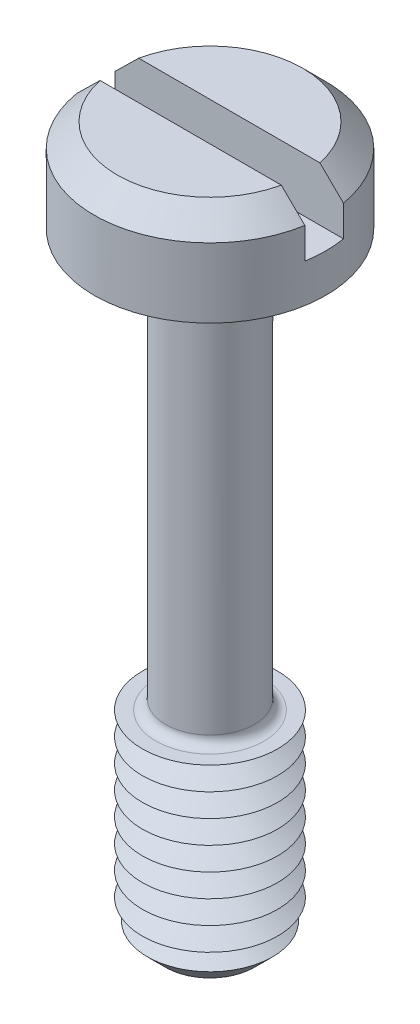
from build123d import *

# Parameters (mm, degrees)
SKETCH1_R           = 3
BOSS_EXTRUDE1_DEPTH = 2.4
SKETCH2_R           = 1.15
BOSS_EXTRUDE2_DEPTH = 16
SKETCH3_R           = 1.75
BOSS_EXTRUDE3_DEPTH = 5.2
CHAMFER1_SIZE       = 0.6
LPATTERN1_COUNT     = 8
LPATTERN1_PITCH     = 0.6
FILLET1_R           = 0.25
CHAMFER2_SIZE       = 0.6
SKETCH6_W           = 6
SKETCH6_H           = 1
CUT_EXTRUDE1_DEPTH  = 1.4


with BuildPart() as part:
    # Sketch1 → Boss-Extrude1 (new body)
    with BuildSketch(Plane(origin=(0, 0, 0), x_dir=(1, 0, 0), z_dir=(0, 1, 0))):
        with Locations(Location((0, 0, 0), (0, 0, 270))):
            Circle(SKETCH1_R)
    extrude(amount=BOSS_EXTRUDE1_DEPTH)

    # Sketch2 → Boss-Extrude2 (add)
    with BuildSketch(Plane.XZ):
        with Locations(Location((0, 0, 0), (0, 0, 270))):
            Circle(SKETCH2_R)
    extrude(amount=BOSS_EXTRUDE2_DEPTH)

    # Sketch3 → Boss-Extrude3 (add)
    with BuildSketch(Plane.XZ.offset(16)):
        with Locations(Location((0, 0, 0), (0, 0, 270))):
            Circle(SKETCH3_R)
    extrude(amount=-BOSS_EXTRUDE3_DEPTH)

    # Chamfer1
    chamfer1_edges = [part.edges().sort_by_distance(p)[0] for p in [
        (0, -16, 1.75),
    ]]
    chamfer(chamfer1_edges, length=CHAMFER1_SIZE)

    # Sketch5 → Cut-Revolve1 (revolve, cut)
    with BuildSketch(Plane(origin=(0, 0, 0), x_dir=(0, 0, -1), z_dir=(1, 0, 0))):
        Polygon((-1.75, -10.8), (-1.230384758, -11.1), (-1.75, -11.4), align=None)
    cut_revolve1 = revolve(axis=Axis((0, -6.58711856, 0), (0, -1, 0)), mode=Mode.SUBTRACT)

    # LPattern1: Cut-Revolve1 ×8
    with Locations(*[(0, -i * LPATTERN1_PITCH, 0) for i in range(1, LPATTERN1_COUNT)]):
        add(cut_revolve1, mode=Mode.SUBTRACT)

    # Fillet1
    fillet1_edges = [part.edges().sort_by_distance(p)[0] for p in [
        (0, 0, 1.15),
        (0, -10.8, 1.15),
    ]]
    fillet(fillet1_edges, radius=FILLET1_R)

    # Chamfer2
    chamfer2_edges = [part.edges().sort_by_distance(p)[0] for p in [
        (0, 2.4, -3),
    ]]
    chamfer(chamfer2_edges, length=CHAMFER2_SIZE)

    # Sketch6 → Cut-Extrude1 (cut)
    with BuildSketch(Plane(origin=(0, 2.4, 0), x_dir=(1, 0, 0), z_dir=(0, 1, 0))):
        Rectangle(SKETCH6_W, SKETCH6_H)
    extrude(amount=-CUT_EXTRUDE1_DEPTH, mode=Mode.SUBTRACT)


solid = part.part
